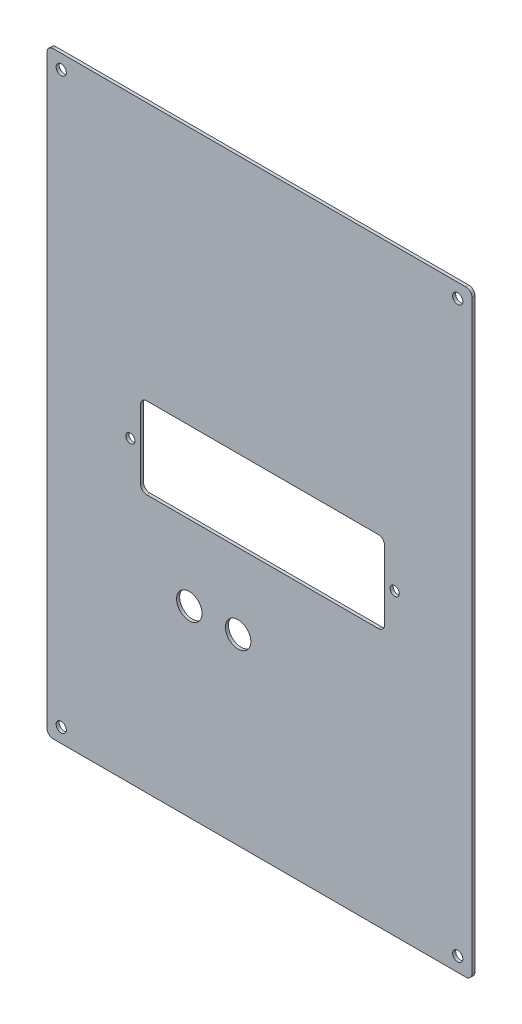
from build123d import *

# Parameters (mm, degrees)
ESQUISSE1_R             = 2.5
BOSS_EXTRU_1_DEPTH      = 1.5
ENL_V_MAT_EXTRU_1_REACH = 362.72
ESQUISSE2_R             = 6.25
ENL_V_MAT_EXTRU_2_REACH = 362.72
ESQUISSE3_R             = 2.25


with BuildPart() as part:
    # Esquisse1 → Boss.-Extru.1 (new body)
    with BuildSketch(Plane.XY):
        with BuildLine():
            Line((3, 0), (206, 0))
            ThreePointArc((206, 0), (208.121320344, 0.878679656), (209, 3))
            Line((209, 3), (209, 291))
            ThreePointArc((209, 291), (208.121320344, 293.121320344), (206, 294))
            Line((206, 294), (3, 294))
            ThreePointArc((3, 294), (0.878679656, 293.121320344), (0, 291))
            Line((0, 291), (0, 63.5))
            Line((0, 63.5), (0, 3))
            ThreePointArc((0, 3), (0.878679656, 0.878679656), (3, 0))
        make_face()
        with Locations((7, 287)):
            Circle(ESQUISSE1_R, mode=Mode.SUBTRACT)
        with Locations((202, 287)):
            Circle(ESQUISSE1_R, mode=Mode.SUBTRACT)
        with Locations((202, 7)):
            Circle(ESQUISSE1_R, mode=Mode.SUBTRACT)
        with Locations((7, 7)):
            Circle(ESQUISSE1_R, mode=Mode.SUBTRACT)
    extrude(amount=BOSS_EXTRU_1_DEPTH)

    # Esquisse2 → Enl_v. mat.-Extru.1 (cut, up to next)
    with BuildSketch(Plane.XY.offset(1.5), mode=Mode.PRIVATE) as enl_v_mat_extru_1_sk1:
        with Locations((70, 90)):
            Circle(ESQUISSE2_R)
    enl_v_mat_extru_1_tool1 = extrude(enl_v_mat_extru_1_sk1.sketch, amount=-ENL_V_MAT_EXTRU_1_REACH, mode=Mode.PRIVATE) & part.part
    # Esquisse2 → Enl_v. mat.-Extru.1 (cut, up to next)
    with BuildSketch(Plane.XY.offset(1.5), mode=Mode.PRIVATE) as enl_v_mat_extru_1_sk2:
        with Locations((94, 90)):
            Circle(ESQUISSE2_R)
    enl_v_mat_extru_1_tool2 = extrude(enl_v_mat_extru_1_sk2.sketch, amount=-ENL_V_MAT_EXTRU_1_REACH, mode=Mode.PRIVATE) & part.part
    add(enl_v_mat_extru_1_tool1.solids().sort_by_distance((70, 90, 1.5))[0], mode=Mode.SUBTRACT)
    add(enl_v_mat_extru_1_tool2.solids().sort_by_distance((94, 90, 1.5))[0], mode=Mode.SUBTRACT)

    # Esquisse3 → Enl_v. mat.-Extru.2 (cut, up to next)
    with BuildSketch(Plane.XY.offset(1.5), mode=Mode.PRIVATE) as enl_v_mat_extru_2_sk1:
        with Locations((41, 147)):
            Circle(ESQUISSE3_R)
    enl_v_mat_extru_2_tool1 = extrude(enl_v_mat_extru_2_sk1.sketch, amount=-ENL_V_MAT_EXTRU_2_REACH, mode=Mode.PRIVATE) & part.part
    # Esquisse3 → Enl_v. mat.-Extru.2 (cut, up to next)
    with BuildSketch(Plane.XY.offset(1.5), mode=Mode.PRIVATE) as enl_v_mat_extru_2_sk2:
        with Locations((171, 147)):
            Circle(ESQUISSE3_R)
    enl_v_mat_extru_2_tool2 = extrude(enl_v_mat_extru_2_sk2.sketch, amount=-ENL_V_MAT_EXTRU_2_REACH, mode=Mode.PRIVATE) & part.part
    # Esquisse3 → Enl_v. mat.-Extru.2 (cut, up to next)
    with BuildSketch(Plane.XY.offset(1.5), mode=Mode.PRIVATE) as enl_v_mat_extru_2_sk3:
        with BuildLine():
            Line((49, 167), (163, 167))
            ThreePointArc((163, 167), (165.121320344, 166.121320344), (166, 164))
            Line((166, 164), (166, 130))
            ThreePointArc((166, 130), (165.121320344, 127.878679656), (163, 127))
            Line((163, 127), (49, 127))
            ThreePointArc((49, 127), (46.878679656, 127.878679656), (46, 130))
            Line((46, 130), (46, 164))
            ThreePointArc((46, 164), (46.878679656, 166.121320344), (49, 167))
        make_face()
    enl_v_mat_extru_2_tool3 = extrude(enl_v_mat_extru_2_sk3.sketch, amount=-ENL_V_MAT_EXTRU_2_REACH, mode=Mode.PRIVATE) & part.part
    add(enl_v_mat_extru_2_tool1.solids().sort_by_distance((41, 147, 1.5))[0], mode=Mode.SUBTRACT)
    add(enl_v_mat_extru_2_tool2.solids().sort_by_distance((171, 147, 1.5))[0], mode=Mode.SUBTRACT)
    add(enl_v_mat_extru_2_tool3.solids().sort_by_distance((106, 147, 1.5))[0], mode=Mode.SUBTRACT)


solid = part.part
